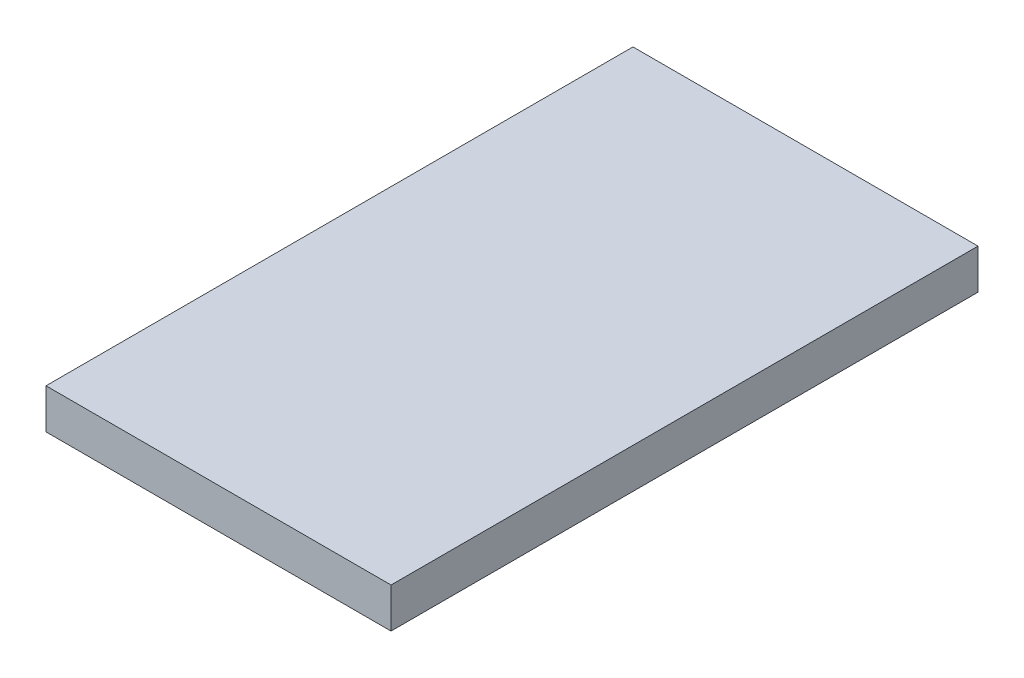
ISO-10303-21;
HEADER;
FILE_DESCRIPTION(('STEP AP214'),'2;1');
FILE_NAME('part.step','',(''),(''),'','','');
FILE_SCHEMA(('AUTOMOTIVE_DESIGN { 1 0 10303 214 1 1 1 1 }'));
ENDSEC;
DATA;
#1=APPLICATION_CONTEXT('core data for automotive mechanical design processes');
#2=APPLICATION_PROTOCOL_DEFINITION('international standard','automotive_design',2000,#1);
#3=PRODUCT_CONTEXT('',#1,'mechanical');
#4=PRODUCT('Part','Part','',(#3));
#5=PRODUCT_RELATED_PRODUCT_CATEGORY('part','',(#4));
#6=PRODUCT_DEFINITION_FORMATION('','',#4);
#7=PRODUCT_DEFINITION_CONTEXT('part definition',#1,'design');
#8=PRODUCT_DEFINITION('design','',#6,#7);
#9=PRODUCT_DEFINITION_SHAPE('','',#8);
#10=(LENGTH_UNIT() NAMED_UNIT(*) SI_UNIT(.MILLI.,.METRE.));
#11=(NAMED_UNIT(*) PLANE_ANGLE_UNIT() SI_UNIT($,.RADIAN.));
#12=(NAMED_UNIT(*) SI_UNIT($,.STERADIAN.) SOLID_ANGLE_UNIT());
#13=UNCERTAINTY_MEASURE_WITH_UNIT(LENGTH_MEASURE(1.E-05),#10,'distance_accuracy_value','');
#14=(GEOMETRIC_REPRESENTATION_CONTEXT(3) GLOBAL_UNCERTAINTY_ASSIGNED_CONTEXT((#13)) GLOBAL_UNIT_ASSIGNED_CONTEXT((#10,
#11,#12)) REPRESENTATION_CONTEXT('',''));
#15=CARTESIAN_POINT('',(0.,0.,0.));
#16=DIRECTION('',(0.,0.,1.));
#17=DIRECTION('',(1.,0.,0.));
#18=AXIS2_PLACEMENT_3D('',#15,#16,#17);
#19=CARTESIAN_POINT('',(-30.861,-3.571875,52.5000000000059));
#20=DIRECTION('',(1.,0.,0.));
#21=DIRECTION('',(0.,0.,-1.));
#22=AXIS2_PLACEMENT_3D('',#19,#20,#21);
#23=PLANE('',#22);
#24=DIRECTION('',(0.,-1.,0.));
#25=VECTOR('',#24,1.);
#26=CARTESIAN_POINT('',(-30.861,-3.571875,-52.5000000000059));
#27=LINE('',#26,#25);
#28=CARTESIAN_POINT('',(-30.861,3.571875,-52.5000000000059));
#29=VERTEX_POINT('',#28);
#30=CARTESIAN_POINT('',(-30.861,-3.571875,-52.5000000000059));
#31=VERTEX_POINT('',#30);
#32=EDGE_CURVE('E111',#29,#31,#27,.T.);
#33=ORIENTED_EDGE('',*,*,#32,.T.);
#34=DIRECTION('',(0.,0.,-1.));
#35=VECTOR('',#34,1.);
#36=CARTESIAN_POINT('',(-30.861,-3.571875,52.5000000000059));
#37=LINE('',#36,#35);
#38=CARTESIAN_POINT('',(-30.861,-3.571875,52.5000000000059));
#39=VERTEX_POINT('',#38);
#40=EDGE_CURVE('E11',#39,#31,#37,.T.);
#41=ORIENTED_EDGE('',*,*,#40,.F.);
#42=DIRECTION('',(0.,-1.,0.));
#43=VECTOR('',#42,1.);
#44=CARTESIAN_POINT('',(-30.861,-3.571875,52.5000000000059));
#45=LINE('',#44,#43);
#46=CARTESIAN_POINT('',(-30.861,3.571875,52.5000000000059));
#47=VERTEX_POINT('',#46);
#48=EDGE_CURVE('E95',#47,#39,#45,.T.);
#49=ORIENTED_EDGE('',*,*,#48,.F.);
#50=DIRECTION('',(0.,0.,-1.));
#51=VECTOR('',#50,1.);
#52=CARTESIAN_POINT('',(-30.861,3.571875,52.5000000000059));
#53=LINE('',#52,#51);
#54=EDGE_CURVE('E107',#47,#29,#53,.T.);
#55=ORIENTED_EDGE('',*,*,#54,.T.);
#56=EDGE_LOOP('',(#33,#41,#49,#55));
#57=FACE_BOUND('',#56,.T.);
#58=ADVANCED_FACE('F43',(#57),#23,.F.);
#59=CARTESIAN_POINT('',(30.861,-3.571875,52.5000000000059));
#60=DIRECTION('',(0.,1.,0.));
#61=DIRECTION('',(0.,0.,1.));
#62=AXIS2_PLACEMENT_3D('',#59,#60,#61);
#63=PLANE('',#62);
#64=DIRECTION('',(1.,0.,0.));
#65=VECTOR('',#64,1.);
#66=CARTESIAN_POINT('',(30.861,-3.571875,-52.5000000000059));
#67=LINE('',#66,#65);
#68=CARTESIAN_POINT('',(30.861,-3.571875,-52.5000000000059));
#69=VERTEX_POINT('',#68);
#70=EDGE_CURVE('E100',#31,#69,#67,.T.);
#71=ORIENTED_EDGE('',*,*,#70,.T.);
#72=DIRECTION('',(0.,0.,-1.));
#73=VECTOR('',#72,1.);
#74=CARTESIAN_POINT('',(30.861,-3.571875,52.5000000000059));
#75=LINE('',#74,#73);
#76=CARTESIAN_POINT('',(30.861,-3.571875,52.5000000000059));
#77=VERTEX_POINT('',#76);
#78=EDGE_CURVE('E52',#77,#69,#75,.T.);
#79=ORIENTED_EDGE('',*,*,#78,.F.);
#80=DIRECTION('',(1.,0.,0.));
#81=VECTOR('',#80,1.);
#82=CARTESIAN_POINT('',(30.861,-3.571875,52.5000000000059));
#83=LINE('',#82,#81);
#84=EDGE_CURVE('E90',#39,#77,#83,.T.);
#85=ORIENTED_EDGE('',*,*,#84,.F.);
#86=ORIENTED_EDGE('',*,*,#40,.T.);
#87=EDGE_LOOP('',(#71,#79,#85,#86));
#88=FACE_BOUND('',#87,.T.);
#89=ADVANCED_FACE('F99',(#88),#63,.F.);
#90=CARTESIAN_POINT('',(30.861,3.571875,52.5000000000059));
#91=DIRECTION('',(-1.,0.,0.));
#92=DIRECTION('',(0.,0.,1.));
#93=AXIS2_PLACEMENT_3D('',#90,#91,#92);
#94=PLANE('',#93);
#95=DIRECTION('',(0.,1.,0.));
#96=VECTOR('',#95,1.);
#97=CARTESIAN_POINT('',(30.861,3.571875,-52.5000000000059));
#98=LINE('',#97,#96);
#99=CARTESIAN_POINT('',(30.861,3.571875,-52.5000000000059));
#100=VERTEX_POINT('',#99);
#101=EDGE_CURVE('E77',#69,#100,#98,.T.);
#102=ORIENTED_EDGE('',*,*,#101,.T.);
#103=DIRECTION('',(0.,0.,-1.));
#104=VECTOR('',#103,1.);
#105=CARTESIAN_POINT('',(30.861,3.571875,52.5000000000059));
#106=LINE('',#105,#104);
#107=CARTESIAN_POINT('',(30.861,3.571875,52.5000000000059));
#108=VERTEX_POINT('',#107);
#109=EDGE_CURVE('E102',#108,#100,#106,.T.);
#110=ORIENTED_EDGE('',*,*,#109,.F.);
#111=DIRECTION('',(0.,1.,0.));
#112=VECTOR('',#111,1.);
#113=CARTESIAN_POINT('',(30.861,3.571875,52.5000000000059));
#114=LINE('',#113,#112);
#115=EDGE_CURVE('E93',#77,#108,#114,.T.);
#116=ORIENTED_EDGE('',*,*,#115,.F.);
#117=ORIENTED_EDGE('',*,*,#78,.T.);
#118=EDGE_LOOP('',(#102,#110,#116,#117));
#119=FACE_BOUND('',#118,.T.);
#120=ADVANCED_FACE('F103',(#119),#94,.F.);
#121=CARTESIAN_POINT('',(-30.861,3.571875,52.5000000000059));
#122=DIRECTION('',(0.,-1.,0.));
#123=DIRECTION('',(0.,0.,-1.));
#124=AXIS2_PLACEMENT_3D('',#121,#122,#123);
#125=PLANE('',#124);
#126=DIRECTION('',(-1.,0.,0.));
#127=VECTOR('',#126,1.);
#128=CARTESIAN_POINT('',(-30.861,3.571875,-52.5000000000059));
#129=LINE('',#128,#127);
#130=EDGE_CURVE('E83',#100,#29,#129,.T.);
#131=ORIENTED_EDGE('',*,*,#130,.T.);
#132=ORIENTED_EDGE('',*,*,#54,.F.);
#133=DIRECTION('',(-1.,0.,0.));
#134=VECTOR('',#133,1.);
#135=CARTESIAN_POINT('',(-30.861,3.571875,52.5000000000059));
#136=LINE('',#135,#134);
#137=EDGE_CURVE('E60',#108,#47,#136,.T.);
#138=ORIENTED_EDGE('',*,*,#137,.F.);
#139=ORIENTED_EDGE('',*,*,#109,.T.);
#140=EDGE_LOOP('',(#131,#132,#138,#139));
#141=FACE_BOUND('',#140,.T.);
#142=ADVANCED_FACE('F124',(#141),#125,.F.);
#143=CARTESIAN_POINT('',(0.,0.,52.5000000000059));
#144=DIRECTION('',(0.,0.,-1.));
#145=DIRECTION('',(-1.,0.,0.));
#146=AXIS2_PLACEMENT_3D('',#143,#144,#145);
#147=PLANE('',#146);
#148=ORIENTED_EDGE('',*,*,#48,.T.);
#149=ORIENTED_EDGE('',*,*,#84,.T.);
#150=ORIENTED_EDGE('',*,*,#115,.T.);
#151=ORIENTED_EDGE('',*,*,#137,.T.);
#152=EDGE_LOOP('',(#148,#149,#150,#151));
#153=FACE_BOUND('',#152,.T.);
#154=ADVANCED_FACE('F91',(#153),#147,.F.);
#155=CARTESIAN_POINT('',(0.,0.,-52.5000000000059));
#156=DIRECTION('',(0.,0.,-1.));
#157=DIRECTION('',(-1.,0.,0.));
#158=AXIS2_PLACEMENT_3D('',#155,#156,#157);
#159=PLANE('',#158);
#160=ORIENTED_EDGE('',*,*,#32,.F.);
#161=ORIENTED_EDGE('',*,*,#130,.F.);
#162=ORIENTED_EDGE('',*,*,#101,.F.);
#163=ORIENTED_EDGE('',*,*,#70,.F.);
#164=EDGE_LOOP('',(#160,#161,#162,#163));
#165=FACE_BOUND('',#164,.T.);
#166=ADVANCED_FACE('F127',(#165),#159,.T.);
#167=CLOSED_SHELL('',(#58,#89,#120,#142,#154,#166));
#168=MANIFOLD_SOLID_BREP('B2',#167);
#169=ADVANCED_BREP_SHAPE_REPRESENTATION('',(#18,#168),#14);
#170=SHAPE_DEFINITION_REPRESENTATION(#9,#169);
ENDSEC;
END-ISO-10303-21;
